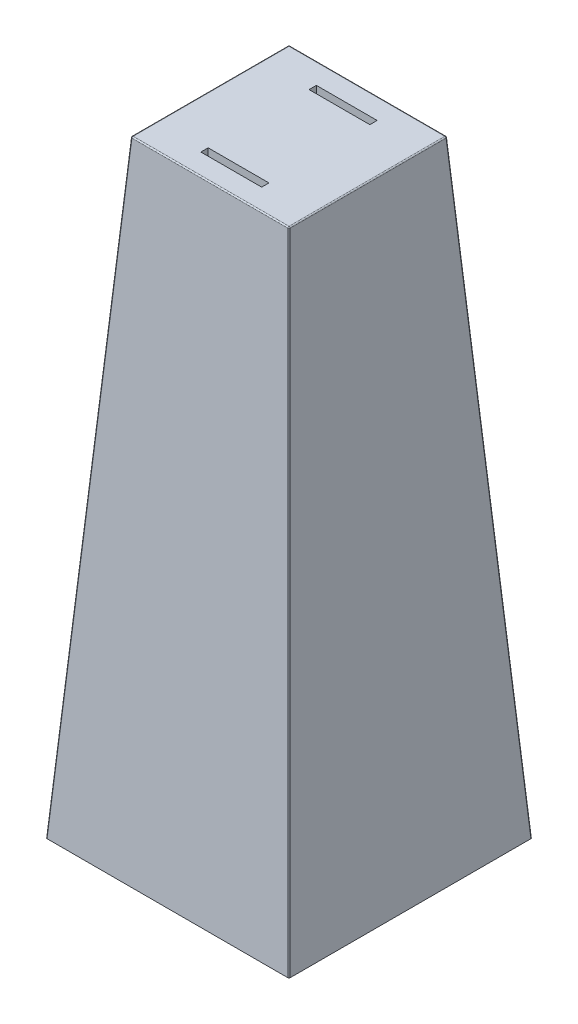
from build123d import *

# Parameters (mm, degrees)
SKETCH1_W               = 130
SKETCH1_H               = 130
EXTRUDE_H_JD_DEPTH      = 500
EXTRUDE_H_JD_DRAFT      = -4
FILLET_KANTAVRUNDNING_R = 1
SKETCH2_W               = 6
SKETCH2_H               = 50
CUT_H_L_DEPTH           = 200


with BuildPart() as part:
    # Sketch1 → Extrude h_jd (with draft: the straight prism first)
    with BuildSketch(Plane(origin=(0, 0, -400), x_dir=(1, 0, 0), z_dir=(0, -1, 0))):
        with Locations((0, 400)):
            Rectangle(SKETCH1_W, SKETCH1_H)
    extrude(amount=EXTRUDE_H_JD_DEPTH)
    # Extrude h_jd: the draft: its side faces are tilted about the plane it starts from
    extrude_h_jd_sides = [part.faces().sort_by_distance(p)[0] for p in [
        (0, -250, 65),
        (-65, -250, 0),
        (0, -250, -65),
        (65, -250, 0),
    ]]
    draft(extrude_h_jd_sides, Plane(origin=(0, 0, -400), x_dir=(1, 0, 0), z_dir=(0, -1, 0)), EXTRUDE_H_JD_DRAFT)

    # Fillet kantavrundning
    fillet_kantavrundning_edges = [part.edges().sort_by_distance(p)[0] for p in [
        (0, 0, -65),
        (-65, 0, 0),
        (0, 0, 65),
        (65, 0, 0),
        (82.481702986, -250, -82.481702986),
        (-82.481702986, -250, -82.481702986),
        (-82.481702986, -250, 82.481702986),
        (82.481702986, -250, 82.481702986),
    ]]
    fillet(fillet_kantavrundning_edges, radius=FILLET_KANTAVRUNDNING_R)

    # Sketch2 → Cut h_l (cut)
    with BuildSketch(Plane(origin=(0, 0, 0), x_dir=(0, 0, -1), z_dir=(0, -1, 0))):
        with Locations((44.5, 0)):
            Rectangle(SKETCH2_W, SKETCH2_H)
        with Locations((-44.5, 0)):
            Rectangle(SKETCH2_W, SKETCH2_H)
    extrude(amount=CUT_H_L_DEPTH, mode=Mode.SUBTRACT)


solid = part.part
